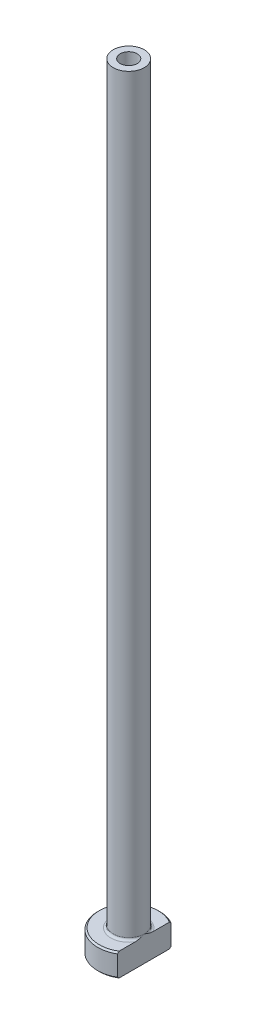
ISO-10303-21;
HEADER;
FILE_DESCRIPTION(('STEP AP214'),'2;1');
FILE_NAME('part.step','',(''),(''),'','','');
FILE_SCHEMA(('AUTOMOTIVE_DESIGN { 1 0 10303 214 1 1 1 1 }'));
ENDSEC;
DATA;
#1=APPLICATION_CONTEXT('core data for automotive mechanical design processes');
#2=APPLICATION_PROTOCOL_DEFINITION('international standard','automotive_design',2000,#1);
#3=PRODUCT_CONTEXT('',#1,'mechanical');
#4=PRODUCT('Part','Part','',(#3));
#5=PRODUCT_RELATED_PRODUCT_CATEGORY('part','',(#4));
#6=PRODUCT_DEFINITION_FORMATION('','',#4);
#7=PRODUCT_DEFINITION_CONTEXT('part definition',#1,'design');
#8=PRODUCT_DEFINITION('design','',#6,#7);
#9=PRODUCT_DEFINITION_SHAPE('','',#8);
#10=(LENGTH_UNIT() NAMED_UNIT(*) SI_UNIT(.MILLI.,.METRE.));
#11=(NAMED_UNIT(*) PLANE_ANGLE_UNIT() SI_UNIT($,.RADIAN.));
#12=(NAMED_UNIT(*) SI_UNIT($,.STERADIAN.) SOLID_ANGLE_UNIT());
#13=UNCERTAINTY_MEASURE_WITH_UNIT(LENGTH_MEASURE(1.E-05),#10,'distance_accuracy_value','');
#14=(GEOMETRIC_REPRESENTATION_CONTEXT(3) GLOBAL_UNCERTAINTY_ASSIGNED_CONTEXT((#13)) GLOBAL_UNIT_ASSIGNED_CONTEXT((#10,
#11,#12)) REPRESENTATION_CONTEXT('',''));
#15=CARTESIAN_POINT('',(0.,0.,0.));
#16=DIRECTION('',(0.,0.,1.));
#17=DIRECTION('',(1.,0.,0.));
#18=AXIS2_PLACEMENT_3D('',#15,#16,#17);
#19=CARTESIAN_POINT('',(0.,92.1876809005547,0.));
#20=DIRECTION('',(0.,1.,0.));
#21=DIRECTION('',(0.,0.,1.));
#22=AXIS2_PLACEMENT_3D('',#19,#20,#21);
#23=CYLINDRICAL_SURFACE('',#22,1.1);
#24=CARTESIAN_POINT('',(0.,100.,0.));
#25=DIRECTION('',(0.,1.,0.));
#26=DIRECTION('',(0.,0.,1.));
#27=AXIS2_PLACEMENT_3D('',#24,#25,#26);
#28=CIRCLE('',#27,1.1);
#29=CARTESIAN_POINT('',(0.,100.,1.1));
#30=VERTEX_POINT('',#29);
#31=EDGE_CURVE('E167',#30,#30,#28,.T.);
#32=ORIENTED_EDGE('',*,*,#31,.T.);
#33=EDGE_LOOP('',(#32));
#34=FACE_BOUND('',#33,.T.);
#35=CARTESIAN_POINT('',(0.,65.,0.));
#36=DIRECTION('',(0.,1.,0.));
#37=DIRECTION('',(0.,0.,1.));
#38=AXIS2_PLACEMENT_3D('',#35,#36,#37);
#39=CIRCLE('',#38,1.1);
#40=CARTESIAN_POINT('',(0.,65.,1.1));
#41=VERTEX_POINT('',#40);
#42=EDGE_CURVE('E170',#41,#41,#39,.T.);
#43=ORIENTED_EDGE('',*,*,#42,.F.);
#44=EDGE_LOOP('',(#43));
#45=FACE_BOUND('',#44,.T.);
#46=ADVANCED_FACE('F32',(#34,#45),#23,.F.);
#47=CARTESIAN_POINT('',(-1.1,100.,0.));
#48=DIRECTION('',(0.,1.,0.));
#49=DIRECTION('',(0.,0.,1.));
#50=AXIS2_PLACEMENT_3D('',#47,#48,#49);
#51=PLANE('',#50);
#52=CARTESIAN_POINT('',(0.,100.,0.));
#53=DIRECTION('',(0.,1.,0.));
#54=DIRECTION('',(0.,0.,1.));
#55=AXIS2_PLACEMENT_3D('',#52,#53,#54);
#56=CIRCLE('',#55,2.);
#57=CARTESIAN_POINT('',(0.,100.,2.));
#58=VERTEX_POINT('',#57);
#59=EDGE_CURVE('E174',#58,#58,#56,.T.);
#60=ORIENTED_EDGE('',*,*,#59,.T.);
#61=EDGE_LOOP('',(#60));
#62=FACE_BOUND('',#61,.T.);
#63=ORIENTED_EDGE('',*,*,#31,.F.);
#64=EDGE_LOOP('',(#63));
#65=FACE_BOUND('',#64,.T.);
#66=ADVANCED_FACE('F157',(#62,#65),#51,.T.);
#67=CARTESIAN_POINT('',(0.,92.1876809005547,0.));
#68=DIRECTION('',(0.,1.,0.));
#69=DIRECTION('',(0.,0.,1.));
#70=AXIS2_PLACEMENT_3D('',#67,#68,#69);
#71=CYLINDRICAL_SURFACE('',#70,1.99999999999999);
#72=CARTESIAN_POINT('',(0.,3.3,0.));
#73=DIRECTION('',(0.,1.,0.));
#74=DIRECTION('',(0.,0.,1.));
#75=AXIS2_PLACEMENT_3D('',#72,#73,#74);
#76=CIRCLE('',#75,1.99999999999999);
#77=CARTESIAN_POINT('',(1.99999999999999,3.3,0.));
#78=VERTEX_POINT('',#77);
#79=EDGE_CURVE('E180',#78,#78,#76,.T.);
#80=ORIENTED_EDGE('',*,*,#79,.T.);
#81=EDGE_LOOP('',(#80));
#82=FACE_BOUND('',#81,.T.);
#83=ORIENTED_EDGE('',*,*,#59,.F.);
#84=EDGE_LOOP('',(#83));
#85=FACE_BOUND('',#84,.T.);
#86=ADVANCED_FACE('F162',(#82,#85),#71,.T.);
#87=CARTESIAN_POINT('',(-1.99999999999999,3.,0.));
#88=DIRECTION('',(0.,1.,0.));
#89=DIRECTION('',(0.,0.,1.));
#90=AXIS2_PLACEMENT_3D('',#87,#88,#89);
#91=PLANE('',#90);
#92=DIRECTION('',(0.,0.,1.));
#93=VECTOR('',#92,1.);
#94=CARTESIAN_POINT('',(1.99999999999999,3.,0.));
#95=LINE('',#94,#93);
#96=CARTESIAN_POINT('',(2.,3.,-3.23109888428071));
#97=VERTEX_POINT('',#96);
#98=CARTESIAN_POINT('',(1.99999999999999,3.,-1.13578166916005));
#99=VERTEX_POINT('',#98);
#100=EDGE_CURVE('E54',#97,#99,#95,.T.);
#101=ORIENTED_EDGE('',*,*,#100,.F.);
#102=CARTESIAN_POINT('',(0.,3.,0.));
#103=DIRECTION('',(0.,1.,0.));
#104=DIRECTION('',(0.,0.,1.));
#105=AXIS2_PLACEMENT_3D('',#102,#103,#104);
#106=CIRCLE('',#105,3.8);
#107=CARTESIAN_POINT('',(1.99999999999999,3.,3.23109888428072));
#108=VERTEX_POINT('',#107);
#109=EDGE_CURVE('E186',#97,#108,#106,.T.);
#110=ORIENTED_EDGE('',*,*,#109,.T.);
#111=CARTESIAN_POINT('',(1.99999999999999,3.,1.13578166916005));
#112=VERTEX_POINT('',#111);
#113=EDGE_CURVE('E134',#112,#108,#95,.T.);
#114=ORIENTED_EDGE('',*,*,#113,.F.);
#115=CARTESIAN_POINT('',(0.,3.,0.));
#116=DIRECTION('',(0.,1.,0.));
#117=DIRECTION('',(0.,0.,1.));
#118=AXIS2_PLACEMENT_3D('',#115,#116,#117);
#119=CIRCLE('',#118,2.29999999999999);
#120=EDGE_CURVE('E183',#112,#99,#119,.F.);
#121=ORIENTED_EDGE('',*,*,#120,.T.);
#122=EDGE_LOOP('',(#101,#110,#114,#121));
#123=FACE_BOUND('',#122,.T.);
#124=ADVANCED_FACE('F197',(#123),#91,.T.);
#125=CARTESIAN_POINT('',(0.,92.1876809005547,0.));
#126=DIRECTION('',(0.,1.,0.));
#127=DIRECTION('',(0.,0.,1.));
#128=AXIS2_PLACEMENT_3D('',#125,#126,#127);
#129=CYLINDRICAL_SURFACE('',#128,3.99999999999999);
#130=DIRECTION('',(0.,-1.,0.));
#131=VECTOR('',#130,1.);
#132=CARTESIAN_POINT('',(1.99999999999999,100.,3.46410161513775));
#133=LINE('',#132,#131);
#134=CARTESIAN_POINT('',(1.99999999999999,2.8,3.46410161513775));
#135=VERTEX_POINT('',#134);
#136=CARTESIAN_POINT('',(1.99999999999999,0.20000000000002,3.46410161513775));
#137=VERTEX_POINT('',#136);
#138=EDGE_CURVE('E82',#135,#137,#133,.T.);
#139=ORIENTED_EDGE('',*,*,#138,.F.);
#140=CARTESIAN_POINT('',(0.,2.8,0.));
#141=DIRECTION('',(0.,1.,0.));
#142=DIRECTION('',(0.,0.,1.));
#143=AXIS2_PLACEMENT_3D('',#140,#141,#142);
#144=CIRCLE('',#143,3.99999999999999);
#145=CARTESIAN_POINT('',(2.,2.8,-3.46410161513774));
#146=VERTEX_POINT('',#145);
#147=EDGE_CURVE('E95',#135,#146,#144,.F.);
#148=ORIENTED_EDGE('',*,*,#147,.T.);
#149=DIRECTION('',(0.,-1.,0.));
#150=VECTOR('',#149,1.);
#151=CARTESIAN_POINT('',(2.,100.,-3.46410161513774));
#152=LINE('',#151,#150);
#153=CARTESIAN_POINT('',(2.,0.200000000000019,-3.46410161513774));
#154=VERTEX_POINT('',#153);
#155=EDGE_CURVE('E192',#146,#154,#152,.T.);
#156=ORIENTED_EDGE('',*,*,#155,.T.);
#157=CARTESIAN_POINT('',(0.,0.20000000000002,0.));
#158=DIRECTION('',(0.,-1.,0.));
#159=DIRECTION('',(0.,0.,-1.));
#160=AXIS2_PLACEMENT_3D('',#157,#158,#159);
#161=CIRCLE('',#160,3.99999999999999);
#162=EDGE_CURVE('E98',#154,#137,#161,.F.);
#163=ORIENTED_EDGE('',*,*,#162,.T.);
#164=EDGE_LOOP('',(#139,#148,#156,#163));
#165=FACE_BOUND('',#164,.T.);
#166=ADVANCED_FACE('F190',(#165),#129,.T.);
#167=CARTESIAN_POINT('',(-3.99999999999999,0.,0.));
#168=DIRECTION('',(0.,-1.,0.));
#169=DIRECTION('',(0.,0.,-1.));
#170=AXIS2_PLACEMENT_3D('',#167,#168,#169);
#171=PLANE('',#170);
#172=CARTESIAN_POINT('',(0.,0.,0.));
#173=DIRECTION('',(0.,-1.,0.));
#174=DIRECTION('',(0.,0.,-1.));
#175=AXIS2_PLACEMENT_3D('',#172,#173,#174);
#176=CIRCLE('',#175,1.84999999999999);
#177=CARTESIAN_POINT('',(0.,0.,-1.84999999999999));
#178=VERTEX_POINT('',#177);
#179=EDGE_CURVE('E40',#178,#178,#176,.F.);
#180=ORIENTED_EDGE('',*,*,#179,.T.);
#181=EDGE_LOOP('',(#180));
#182=FACE_BOUND('',#181,.T.);
#183=DIRECTION('',(0.,0.,-1.));
#184=VECTOR('',#183,1.);
#185=CARTESIAN_POINT('',(1.99999999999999,0.,3.46410161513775));
#186=LINE('',#185,#184);
#187=CARTESIAN_POINT('',(1.99999999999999,0.,3.23109888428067));
#188=VERTEX_POINT('',#187);
#189=CARTESIAN_POINT('',(2.,0.,-3.23109888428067));
#190=VERTEX_POINT('',#189);
#191=EDGE_CURVE('E47',#188,#190,#186,.T.);
#192=ORIENTED_EDGE('',*,*,#191,.F.);
#193=CARTESIAN_POINT('',(0.,0.,0.));
#194=DIRECTION('',(0.,-1.,0.));
#195=DIRECTION('',(0.,0.,-1.));
#196=AXIS2_PLACEMENT_3D('',#193,#194,#195);
#197=CIRCLE('',#196,3.79999999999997);
#198=EDGE_CURVE('E92',#188,#190,#197,.T.);
#199=ORIENTED_EDGE('',*,*,#198,.T.);
#200=EDGE_LOOP('',(#192,#199));
#201=FACE_BOUND('',#200,.T.);
#202=ADVANCED_FACE('F91',(#182,#201),#171,.T.);
#203=CARTESIAN_POINT('',(0.,92.1876809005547,0.));
#204=DIRECTION('',(0.,1.,0.));
#205=DIRECTION('',(0.,0.,1.));
#206=AXIS2_PLACEMENT_3D('',#203,#204,#205);
#207=CYLINDRICAL_SURFACE('',#206,1.34999999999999);
#208=CARTESIAN_POINT('',(0.,0.5,0.));
#209=DIRECTION('',(0.,-1.,0.));
#210=DIRECTION('',(0.,0.,-1.));
#211=AXIS2_PLACEMENT_3D('',#208,#209,#210);
#212=CIRCLE('',#211,1.34999999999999);
#213=CARTESIAN_POINT('',(0.,0.5,-1.34999999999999));
#214=VERTEX_POINT('',#213);
#215=EDGE_CURVE('E11',#214,#214,#212,.T.);
#216=ORIENTED_EDGE('',*,*,#215,.T.);
#217=EDGE_LOOP('',(#216));
#218=FACE_BOUND('',#217,.T.);
#219=CARTESIAN_POINT('',(0.,53.,0.));
#220=DIRECTION('',(0.,1.,0.));
#221=DIRECTION('',(0.,0.,1.));
#222=AXIS2_PLACEMENT_3D('',#219,#220,#221);
#223=CIRCLE('',#222,1.35);
#224=CARTESIAN_POINT('',(0.,53.,1.35));
#225=VERTEX_POINT('',#224);
#226=EDGE_CURVE('E172',#225,#225,#223,.T.);
#227=ORIENTED_EDGE('',*,*,#226,.T.);
#228=EDGE_LOOP('',(#227));
#229=FACE_BOUND('',#228,.T.);
#230=ADVANCED_FACE('F215',(#218,#229),#207,.F.);
#231=CARTESIAN_POINT('',(0.,53.,0.));
#232=DIRECTION('',(0.,-1.,0.));
#233=DIRECTION('',(0.,0.,-1.));
#234=AXIS2_PLACEMENT_3D('',#231,#232,#233);
#235=CONICAL_SURFACE('',#234,1.35,0.0208303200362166);
#236=ORIENTED_EDGE('',*,*,#42,.T.);
#237=EDGE_LOOP('',(#236));
#238=FACE_BOUND('',#237,.T.);
#239=ORIENTED_EDGE('',*,*,#226,.F.);
#240=EDGE_LOOP('',(#239));
#241=FACE_BOUND('',#240,.T.);
#242=ADVANCED_FACE('F111',(#238,#241),#235,.F.);
#243=CARTESIAN_POINT('',(0.,3.3,0.));
#244=DIRECTION('',(0.,1.,0.));
#245=DIRECTION('',(0.,0.,1.));
#246=AXIS2_PLACEMENT_3D('',#243,#244,#245);
#247=TOROIDAL_SURFACE('',#246,2.29999999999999,0.3);
#248=ORIENTED_EDGE('',*,*,#120,.F.);
#249=CARTESIAN_POINT('',(1.99999999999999,3.3,0.));
#250=CARTESIAN_POINT('',(1.99999999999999,3.30000062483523,7.91058839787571E-11));
#251=CARTESIAN_POINT('',(1.99999999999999,3.30000124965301,1.38466933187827E-07));
#252=CARTESIAN_POINT('',(1.99999999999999,3.30000244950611,5.7250701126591E-07));
#253=CARTESIAN_POINT('',(1.99999999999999,3.30000302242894,8.72848879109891E-07));
#254=CARTESIAN_POINT('',(1.99999999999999,3.30000416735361,1.5933593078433E-06));
#255=CARTESIAN_POINT('',(1.99999999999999,3.30000473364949,2.02244682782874E-06));
#256=CARTESIAN_POINT('',(1.99999999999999,3.30000579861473,2.94494833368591E-06));
#257=CARTESIAN_POINT('',(1.99999999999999,3.3000062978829,3.43770297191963E-06));
#258=CARTESIAN_POINT('',(1.99999999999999,3.30000798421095,5.21460055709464E-06));
#259=CARTESIAN_POINT('',(1.99999999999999,3.30000908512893,6.58180891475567E-06));
#260=CARTESIAN_POINT('',(1.99999999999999,3.30001103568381,9.39775301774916E-06));
#261=CARTESIAN_POINT('',(1.99999999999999,3.30001189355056,1.08411098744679E-05));
#262=CARTESIAN_POINT('',(1.99999999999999,3.30001514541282,1.6512277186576E-05));
#263=CARTESIAN_POINT('',(1.99999999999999,3.30001737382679,2.08398778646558E-05));
#264=CARTESIAN_POINT('',(1.99999999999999,3.30002099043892,2.93440758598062E-05));
#265=CARTESIAN_POINT('',(1.99999999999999,3.30002243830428,3.34960292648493E-05));
#266=CARTESIAN_POINT('',(1.99999999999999,3.30002863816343,5.12890566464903E-05));
#267=CARTESIAN_POINT('',(1.99999999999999,3.30003337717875,6.49250928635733E-05));
#268=CARTESIAN_POINT('',(1.99999999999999,3.3000409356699,9.03829816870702E-05));
#269=CARTESIAN_POINT('',(2.,3.30004394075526,0.000102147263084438));
#270=CARTESIAN_POINT('',(2.,3.3000678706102,0.000188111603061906));
#271=CARTESIAN_POINT('',(2.,3.30009855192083,0.000259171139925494));
#272=CARTESIAN_POINT('',(1.99999999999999,3.30021378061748,0.000536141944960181));
#273=CARTESIAN_POINT('',(1.99999999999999,3.30029106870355,0.000744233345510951));
#274=CARTESIAN_POINT('',(2.,3.3005964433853,0.00155446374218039));
#275=CARTESIAN_POINT('',(2.,3.30083214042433,0.00215436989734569));
#276=CARTESIAN_POINT('',(1.99999999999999,3.30179425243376,0.00461477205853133));
#277=CARTESIAN_POINT('',(1.99999999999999,3.30251207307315,0.00647773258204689));
#278=CARTESIAN_POINT('',(2.00000000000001,3.31311632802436,0.0339840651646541));
#279=CARTESIAN_POINT('',(2.,3.32306890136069,0.0596088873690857));
#280=CARTESIAN_POINT('',(1.99999999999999,3.34248629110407,0.10994696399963));
#281=CARTESIAN_POINT('',(1.99999999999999,3.35195547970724,0.134658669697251));
#282=CARTESIAN_POINT('',(2.,3.37186796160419,0.187046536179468));
#283=CARTESIAN_POINT('',(2.,3.38229466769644,0.21472913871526));
#284=CARTESIAN_POINT('',(1.99999999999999,3.40297705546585,0.270480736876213));
#285=CARTESIAN_POINT('',(2.,3.41322989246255,0.298550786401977));
#286=CARTESIAN_POINT('',(2.,3.43806738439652,0.3680077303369));
#287=CARTESIAN_POINT('',(2.,3.45243182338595,0.409474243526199));
#288=CARTESIAN_POINT('',(2.,3.47965482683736,0.491807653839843));
#289=CARTESIAN_POINT('',(2.,3.49254110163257,0.53266532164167));
#290=CARTESIAN_POINT('',(2.,3.51851192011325,0.620554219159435));
#291=CARTESIAN_POINT('',(2.,3.53137383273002,0.667652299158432));
#292=CARTESIAN_POINT('',(2.,3.55459547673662,0.762854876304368));
#293=CARTESIAN_POINT('',(2.,3.56493539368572,0.810964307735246));
#294=CARTESIAN_POINT('',(2.,3.58270957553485,0.910933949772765));
#295=CARTESIAN_POINT('',(2.,3.58991426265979,0.962836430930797));
#296=CARTESIAN_POINT('',(2.,3.59906919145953,1.06698400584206));
#297=CARTESIAN_POINT('',(2.,3.60103790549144,1.11922724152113));
#298=CARTESIAN_POINT('',(2.,3.59819318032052,1.21399009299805));
#299=CARTESIAN_POINT('',(2.,3.59455548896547,1.25653871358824));
#300=CARTESIAN_POINT('',(2.,3.58116512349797,1.34017723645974));
#301=CARTESIAN_POINT('',(2.,3.5715020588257,1.38127935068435));
#302=CARTESIAN_POINT('',(2.,3.55087659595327,1.4410977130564));
#303=CARTESIAN_POINT('',(2.,3.54291246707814,1.46084510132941));
#304=CARTESIAN_POINT('',(2.,3.52453399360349,1.49924523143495));
#305=CARTESIAN_POINT('',(2.,3.51411538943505,1.51789599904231));
#306=CARTESIAN_POINT('',(2.,3.49255299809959,1.55022658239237));
#307=CARTESIAN_POINT('',(2.,3.48185951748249,1.56420357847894));
#308=CARTESIAN_POINT('',(2.,3.45839348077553,1.59028758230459));
#309=CARTESIAN_POINT('',(2.,3.44562585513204,1.60239889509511));
#310=CARTESIAN_POINT('',(2.,3.42183279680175,1.62093425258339));
#311=CARTESIAN_POINT('',(2.,3.41131183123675,1.6280029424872));
#312=CARTESIAN_POINT('',(2.,3.38926242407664,1.64036132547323));
#313=CARTESIAN_POINT('',(2.,3.37773458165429,1.64565206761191));
#314=CARTESIAN_POINT('',(2.,3.3537976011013,1.65410966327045));
#315=CARTESIAN_POINT('',(2.,3.34138166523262,1.65725762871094));
#316=CARTESIAN_POINT('',(2.,3.31617371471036,1.661060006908));
#317=CARTESIAN_POINT('',(2.,3.30338200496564,1.66171638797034));
#318=CARTESIAN_POINT('',(2.,3.27959278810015,1.6605584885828));
#319=CARTESIAN_POINT('',(2.,3.26857876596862,1.65905512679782));
#320=CARTESIAN_POINT('',(2.,3.24695777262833,1.65423593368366));
#321=CARTESIAN_POINT('',(2.,3.2363508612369,1.65091983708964));
#322=CARTESIAN_POINT('',(2.,3.21566894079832,1.64264699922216));
#323=CARTESIAN_POINT('',(2.,3.20560117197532,1.63767239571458));
#324=CARTESIAN_POINT('',(2.,3.18626855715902,1.62636415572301));
#325=CARTESIAN_POINT('',(2.,3.1770040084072,1.62003001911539));
#326=CARTESIAN_POINT('',(2.,3.15429988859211,1.60233802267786));
#327=CARTESIAN_POINT('',(2.,3.14148777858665,1.59017362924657));
#328=CARTESIAN_POINT('',(2.,3.11794267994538,1.56396532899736));
#329=CARTESIAN_POINT('',(2.,3.10721625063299,1.54991572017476));
#330=CARTESIAN_POINT('',(2.,3.08234423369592,1.5125320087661));
#331=CARTESIAN_POINT('',(2.,3.06952968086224,1.48831711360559));
#332=CARTESIAN_POINT('',(2.,3.0477395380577,1.43832020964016));
#333=CARTESIAN_POINT('',(2.,3.03876197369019,1.41253901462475));
#334=CARTESIAN_POINT('',(2.,3.01850750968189,1.34101817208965));
#335=CARTESIAN_POINT('',(2.,3.01031623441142,1.29441496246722));
#336=CARTESIAN_POINT('',(2.,3.00061264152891,1.19993212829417));
#337=CARTESIAN_POINT('',(2.,2.99920833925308,1.15204398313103));
#338=CARTESIAN_POINT('',(2.,3.00193088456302,1.04246961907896));
#339=CARTESIAN_POINT('',(2.,3.0077920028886,0.980836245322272));
#340=CARTESIAN_POINT('',(2.,3.0256292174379,0.858294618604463));
#341=CARTESIAN_POINT('',(2.,3.03763032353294,0.797390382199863));
#342=CARTESIAN_POINT('',(2.,3.06494905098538,0.681046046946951));
#343=CARTESIAN_POINT('',(2.,3.07996031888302,0.625531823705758));
#344=CARTESIAN_POINT('',(2.,3.11250087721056,0.515805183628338));
#345=CARTESIAN_POINT('',(2.,3.13000629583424,0.461585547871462));
#346=CARTESIAN_POINT('',(2.,3.15814737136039,0.379074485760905));
#347=CARTESIAN_POINT('',(2.,3.16814918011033,0.350562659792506));
#348=CARTESIAN_POINT('',(2.,3.18879761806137,0.292954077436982));
#349=CARTESIAN_POINT('',(2.,3.19945417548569,0.263860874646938));
#350=CARTESIAN_POINT('',(2.,3.21767622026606,0.214869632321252));
#351=CARTESIAN_POINT('',(2.,3.22516548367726,0.194943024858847));
#352=CARTESIAN_POINT('',(2.,3.24017206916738,0.15532752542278));
#353=CARTESIAN_POINT('',(2.,3.24768836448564,0.135638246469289));
#354=CARTESIAN_POINT('',(1.99999999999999,3.26198776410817,0.098344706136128));
#355=CARTESIAN_POINT('',(1.99999999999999,3.26876515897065,0.0807381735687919));
#356=CARTESIAN_POINT('',(2.,3.28263254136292,0.0448719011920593));
#357=CARTESIAN_POINT('',(2.,3.28972459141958,0.0266128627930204));
#358=CARTESIAN_POINT('',(1.99999999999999,3.29748742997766,0.00647923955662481));
#359=CARTESIAN_POINT('',(1.99999999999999,3.29820461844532,0.00461774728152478));
#360=CARTESIAN_POINT('',(2.,3.29916656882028,0.00215769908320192));
#361=CARTESIAN_POINT('',(2.,3.29940270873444,0.00155667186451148));
#362=CARTESIAN_POINT('',(1.99999999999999,3.2997086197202,0.000745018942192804));
#363=CARTESIAN_POINT('',(1.99999999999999,3.29978601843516,0.000536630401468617));
#364=CARTESIAN_POINT('',(2.,3.29990139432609,0.000259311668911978));
#365=CARTESIAN_POINT('',(2.,3.2999320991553,0.000188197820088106));
#366=CARTESIAN_POINT('',(2.,3.29995604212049,0.0001021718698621));
#367=CARTESIAN_POINT('',(1.99999999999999,3.29995904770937,9.04035938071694E-05));
#368=CARTESIAN_POINT('',(1.99999999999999,3.29996660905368,6.49368757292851E-05));
#369=CARTESIAN_POINT('',(1.99999999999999,3.29997135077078,5.12961127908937E-05));
#370=CARTESIAN_POINT('',(1.99999999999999,3.29997755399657,3.34977848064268E-05));
#371=CARTESIAN_POINT('',(1.99999999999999,3.29997900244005,2.93452177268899E-05));
#372=CARTESIAN_POINT('',(1.99999999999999,3.29998262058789,2.08398566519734E-05));
#373=CARTESIAN_POINT('',(1.99999999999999,3.29998484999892,1.65117297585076E-05));
#374=CARTESIAN_POINT('',(1.99999999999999,3.29998810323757,1.08400635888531E-05));
#375=CARTESIAN_POINT('',(1.99999999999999,3.29998896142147,9.39665900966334E-06));
#376=CARTESIAN_POINT('',(1.99999999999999,3.29999091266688,6.58068185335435E-06));
#377=CARTESIAN_POINT('',(1.99999999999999,3.2999920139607,5.2134916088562E-06));
#378=CARTESIAN_POINT('',(1.99999999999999,3.29999370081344,3.43669337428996E-06));
#379=CARTESIAN_POINT('',(1.99999999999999,3.29999420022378,2.94398228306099E-06));
#380=CARTESIAN_POINT('',(1.99999999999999,3.29999526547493,2.0215933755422E-06));
#381=CARTESIAN_POINT('',(1.99999999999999,3.2999958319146,1.5925752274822E-06));
#382=CARTESIAN_POINT('',(1.99999999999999,3.29999697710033,8.72232370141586E-07));
#383=CARTESIAN_POINT('',(1.99999999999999,3.29999755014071,5.71985041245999E-07));
#384=CARTESIAN_POINT('',(1.99999999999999,3.29999875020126,1.38175028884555E-07));
#385=CARTESIAN_POINT('',(1.99999999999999,3.29999937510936,-7.91123985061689E-11));
#386=CARTESIAN_POINT('',(1.99999999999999,3.3,0.));
#387=B_SPLINE_CURVE_WITH_KNOTS('',3,(#249,#250,#251,#252,#253,#254,#255,#256,#257,#258,#259,
#260,#261,#262,#263,#264,#265,#266,#267,#268,#269,#270,#271,#272,#273,#274,#275,#276,#277,#278,
#279,#280,#281,#282,#283,#284,#285,#286,#287,#288,#289,#290,#291,#292,#293,#294,#295,#296,#297,
#298,#299,#300,#301,#302,#303,#304,#305,#306,#307,#308,#309,#310,#311,#312,#313,#314,#315,#316,
#317,#318,#319,#320,#321,#322,#323,#324,#325,#326,#327,#328,#329,#330,#331,#332,#333,#334,#335,
#336,#337,#338,#339,#340,#341,#342,#343,#344,#345,#346,#347,#348,#349,#350,#351,#352,#353,#354,
#355,#356,#357,#358,#359,#360,#361,#362,#363,#364,#365,#366,#367,#368,#369,#370,#371,#372,#373,
#374,#375,#376,#377,#378,#379,#380,#381,#382,#383,#384,#385,#386),.UNSPECIFIED.,.T.,.F.,(4,2,2,
2,2,2,2,2,2,2,2,2,2,2,2,2,2,2,2,2,2,2,2,2,2,2,2,2,2,2,2,2,2,2,2,2,2,2,2,2,2,2,2,2,2,2,2,2,2,2,2,
2,2,2,2,2,2,2,2,2,2,2,2,2,2,2,2,2,4),(0.,1.87392294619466E-06,3.80527491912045E-06,
5.92782328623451E-06,8.02992883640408E-06,1.32707966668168E-05,1.83039493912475E-05,
3.28629532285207E-05,4.60403137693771E-05,8.93409898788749E-05,0.000125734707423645,
0.000357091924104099,0.0010237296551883,0.00295649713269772,0.00894682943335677,
0.0914075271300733,0.170800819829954,0.259542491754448,0.349192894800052,0.480831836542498,
0.609336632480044,0.755749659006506,0.903278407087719,1.06029304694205,1.21675300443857,
1.34456674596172,1.47052354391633,1.53427785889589,1.59814364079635,1.65076980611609,
1.70327265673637,1.74115950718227,1.77902396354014,1.81721800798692,1.85538187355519,
1.88857073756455,1.92176445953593,1.95532789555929,1.98890369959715,2.0416028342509,
2.09446511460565,2.17619131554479,2.2578754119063,2.39903747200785,2.54243890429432,
2.72770087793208,2.91372355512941,3.08615579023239,3.25703652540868,3.34768022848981,
3.44062797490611,3.50449043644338,3.56771526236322,3.62431442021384,3.68307253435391,
3.68905809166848,3.6909944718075,3.69166206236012,3.69189359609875,3.69193000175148,
3.69197331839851,3.69198649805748,3.69200105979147,3.69200609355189,3.69201133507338,
3.69201343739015,3.69201556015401,3.69201749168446,3.69201936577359),.UNSPECIFIED.);
#388=EDGE_CURVE('E126',#112,#78,#387,.T.);
#389=ORIENTED_EDGE('',*,*,#388,.T.);
#390=ORIENTED_EDGE('',*,*,#79,.F.);
#391=CARTESIAN_POINT('',(1.99999999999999,3.3,0.));
#392=CARTESIAN_POINT('',(1.99999999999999,3.29999937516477,-7.91054267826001E-11));
#393=CARTESIAN_POINT('',(1.99999999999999,3.29999875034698,-1.38466932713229E-07));
#394=CARTESIAN_POINT('',(1.99999999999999,3.29999755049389,-5.7250701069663E-07));
#395=CARTESIAN_POINT('',(1.99999999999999,3.29999697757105,-8.72848878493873E-07));
#396=CARTESIAN_POINT('',(1.99999999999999,3.29999583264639,-1.59335930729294E-06));
#397=CARTESIAN_POINT('',(1.99999999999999,3.29999526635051,-2.02244682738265E-06));
#398=CARTESIAN_POINT('',(1.99999999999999,3.29999420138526,-2.94494833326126E-06));
#399=CARTESIAN_POINT('',(1.99999999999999,3.2999937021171,-3.43770297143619E-06));
#400=CARTESIAN_POINT('',(1.99999999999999,3.29999201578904,-5.21460055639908E-06));
#401=CARTESIAN_POINT('',(1.99999999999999,3.29999091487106,-6.58180891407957E-06));
#402=CARTESIAN_POINT('',(1.99999999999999,3.29998896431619,-9.39775301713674E-06));
#403=CARTESIAN_POINT('',(1.99999999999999,3.29998810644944,-1.08411098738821E-05));
#404=CARTESIAN_POINT('',(1.99999999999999,3.29998485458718,-1.65122771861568E-05));
#405=CARTESIAN_POINT('',(1.99999999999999,3.29998262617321,-2.08398778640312E-05));
#406=CARTESIAN_POINT('',(1.99999999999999,3.29997900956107,-2.93440758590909E-05));
#407=CARTESIAN_POINT('',(1.99999999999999,3.29997756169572,-3.34960292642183E-05));
#408=CARTESIAN_POINT('',(1.99999999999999,3.29997136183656,-5.12890566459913E-05));
#409=CARTESIAN_POINT('',(1.99999999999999,3.29996662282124,-6.49250928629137E-05));
#410=CARTESIAN_POINT('',(1.99999999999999,3.2999590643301,-9.03829816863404E-05));
#411=CARTESIAN_POINT('',(2.,3.29995605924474,-0.000102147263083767));
#412=CARTESIAN_POINT('',(2.,3.29993212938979,-0.000188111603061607));
#413=CARTESIAN_POINT('',(2.,3.29990144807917,-0.000259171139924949));
#414=CARTESIAN_POINT('',(1.99999999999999,3.29978621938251,-0.000536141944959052));
#415=CARTESIAN_POINT('',(1.99999999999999,3.29970893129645,-0.000744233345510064));
#416=CARTESIAN_POINT('',(2.,3.2994035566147,-0.00155446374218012));
#417=CARTESIAN_POINT('',(2.,3.29916785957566,-0.00215436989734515));
#418=CARTESIAN_POINT('',(1.99999999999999,3.29820574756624,-0.00461477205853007));
#419=CARTESIAN_POINT('',(1.99999999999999,3.29748792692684,-0.00647773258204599));
#420=CARTESIAN_POINT('',(2.00000000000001,3.28688367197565,-0.0339840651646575));
#421=CARTESIAN_POINT('',(2.,3.27693109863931,-0.0596088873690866));
#422=CARTESIAN_POINT('',(1.99999999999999,3.25751370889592,-0.109946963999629));
#423=CARTESIAN_POINT('',(1.99999999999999,3.24804452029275,-0.134658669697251));
#424=CARTESIAN_POINT('',(2.,3.2281320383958,-0.187046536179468));
#425=CARTESIAN_POINT('',(2.,3.21770533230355,-0.214729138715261));
#426=CARTESIAN_POINT('',(1.99999999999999,3.19702294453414,-0.270480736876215));
#427=CARTESIAN_POINT('',(2.,3.18677010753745,-0.298550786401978));
#428=CARTESIAN_POINT('',(2.,3.16193261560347,-0.368007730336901));
#429=CARTESIAN_POINT('',(2.,3.14756817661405,-0.4094742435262));
#430=CARTESIAN_POINT('',(2.,3.12034517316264,-0.491807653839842));
#431=CARTESIAN_POINT('',(2.,3.10745889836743,-0.532665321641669));
#432=CARTESIAN_POINT('',(2.,3.08148807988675,-0.620554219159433));
#433=CARTESIAN_POINT('',(2.,3.06862616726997,-0.66765229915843));
#434=CARTESIAN_POINT('',(2.,3.04540452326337,-0.762854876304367));
#435=CARTESIAN_POINT('',(2.,3.03506460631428,-0.810964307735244));
#436=CARTESIAN_POINT('',(2.,3.01729042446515,-0.910933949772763));
#437=CARTESIAN_POINT('',(2.,3.01008573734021,-0.962836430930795));
#438=CARTESIAN_POINT('',(2.,3.00093080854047,-1.06698400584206));
#439=CARTESIAN_POINT('',(2.,2.99896209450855,-1.11922724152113));
#440=CARTESIAN_POINT('',(2.,3.00180681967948,-1.21399009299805));
#441=CARTESIAN_POINT('',(2.,3.00544451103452,-1.25653871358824));
#442=CARTESIAN_POINT('',(2.,3.01883487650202,-1.34017723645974));
#443=CARTESIAN_POINT('',(2.,3.0284979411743,-1.38127935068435));
#444=CARTESIAN_POINT('',(2.,3.04912340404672,-1.4410977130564));
#445=CARTESIAN_POINT('',(2.,3.05708753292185,-1.46084510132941));
#446=CARTESIAN_POINT('',(2.,3.0754660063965,-1.49924523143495));
#447=CARTESIAN_POINT('',(2.,3.08588461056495,-1.51789599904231));
#448=CARTESIAN_POINT('',(2.,3.10744700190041,-1.55022658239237));
#449=CARTESIAN_POINT('',(2.,3.11814048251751,-1.56420357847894));
#450=CARTESIAN_POINT('',(2.,3.14160651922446,-1.59028758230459));
#451=CARTESIAN_POINT('',(2.,3.15437414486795,-1.60239889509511));
#452=CARTESIAN_POINT('',(2.,3.17816720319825,-1.62093425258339));
#453=CARTESIAN_POINT('',(2.,3.18868816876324,-1.6280029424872));
#454=CARTESIAN_POINT('',(2.,3.21073757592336,-1.64036132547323));
#455=CARTESIAN_POINT('',(2.,3.2222654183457,-1.64565206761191));
#456=CARTESIAN_POINT('',(2.,3.2462023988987,-1.65410966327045));
#457=CARTESIAN_POINT('',(2.,3.25861833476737,-1.65725762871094));
#458=CARTESIAN_POINT('',(2.,3.28382628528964,-1.661060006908));
#459=CARTESIAN_POINT('',(2.,3.29661799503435,-1.66171638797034));
#460=CARTESIAN_POINT('',(2.,3.32040721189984,-1.6605584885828));
#461=CARTESIAN_POINT('',(2.,3.33142123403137,-1.65905512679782));
#462=CARTESIAN_POINT('',(2.,3.35304222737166,-1.65423593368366));
#463=CARTESIAN_POINT('',(2.,3.36364913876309,-1.65091983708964));
#464=CARTESIAN_POINT('',(2.,3.38433105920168,-1.64264699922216));
#465=CARTESIAN_POINT('',(2.,3.39439882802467,-1.63767239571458));
#466=CARTESIAN_POINT('',(2.,3.41373144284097,-1.62636415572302));
#467=CARTESIAN_POINT('',(2.,3.42299599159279,-1.62003001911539));
#468=CARTESIAN_POINT('',(2.,3.44570011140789,-1.60233802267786));
#469=CARTESIAN_POINT('',(2.,3.45851222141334,-1.59017362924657));
#470=CARTESIAN_POINT('',(2.,3.48205732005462,-1.56396532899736));
#471=CARTESIAN_POINT('',(2.,3.492783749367,-1.54991572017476));
#472=CARTESIAN_POINT('',(2.,3.51765576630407,-1.5125320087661));
#473=CARTESIAN_POINT('',(2.,3.53047031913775,-1.48831711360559));
#474=CARTESIAN_POINT('',(2.,3.55226046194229,-1.43832020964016));
#475=CARTESIAN_POINT('',(2.,3.56123802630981,-1.41253901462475));
#476=CARTESIAN_POINT('',(2.,3.58149249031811,-1.34101817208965));
#477=CARTESIAN_POINT('',(2.,3.58968376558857,-1.29441496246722));
#478=CARTESIAN_POINT('',(2.,3.59938735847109,-1.19993212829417));
#479=CARTESIAN_POINT('',(2.,3.60079166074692,-1.15204398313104));
#480=CARTESIAN_POINT('',(2.,3.59806911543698,-1.04246961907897));
#481=CARTESIAN_POINT('',(2.,3.5922079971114,-0.980836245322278));
#482=CARTESIAN_POINT('',(2.,3.57437078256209,-0.858294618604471));
#483=CARTESIAN_POINT('',(2.,3.56236967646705,-0.797390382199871));
#484=CARTESIAN_POINT('',(2.,3.53505094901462,-0.68104604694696));
#485=CARTESIAN_POINT('',(2.,3.52003968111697,-0.625531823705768));
#486=CARTESIAN_POINT('',(2.,3.48749912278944,-0.51580518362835));
#487=CARTESIAN_POINT('',(2.,3.46999370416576,-0.461585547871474));
#488=CARTESIAN_POINT('',(2.,3.44185262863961,-0.379074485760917));
#489=CARTESIAN_POINT('',(2.,3.43185081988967,-0.350562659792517));
#490=CARTESIAN_POINT('',(2.,3.41120238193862,-0.292954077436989));
#491=CARTESIAN_POINT('',(2.,3.40054582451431,-0.263860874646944));
#492=CARTESIAN_POINT('',(2.,3.38232377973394,-0.214869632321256));
#493=CARTESIAN_POINT('',(2.,3.37483451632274,-0.194943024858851));
#494=CARTESIAN_POINT('',(2.,3.35982793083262,-0.155327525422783));
#495=CARTESIAN_POINT('',(2.,3.35231163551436,-0.135638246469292));
#496=CARTESIAN_POINT('',(1.99999999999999,3.33801223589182,-0.0983447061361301));
#497=CARTESIAN_POINT('',(1.99999999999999,3.33123484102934,-0.0807381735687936));
#498=CARTESIAN_POINT('',(2.,3.31736745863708,-0.0448719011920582));
#499=CARTESIAN_POINT('',(2.,3.31027540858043,-0.0266128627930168));
#500=CARTESIAN_POINT('',(1.99999999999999,3.30251257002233,-0.00647923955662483));
#501=CARTESIAN_POINT('',(1.99999999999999,3.30179538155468,-0.00461774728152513));
#502=CARTESIAN_POINT('',(2.,3.30083343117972,-0.00215769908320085));
#503=CARTESIAN_POINT('',(2.,3.30059729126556,-0.00155667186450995));
#504=CARTESIAN_POINT('',(1.99999999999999,3.30029138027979,-0.000745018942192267));
#505=CARTESIAN_POINT('',(1.99999999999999,3.30021398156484,-0.000536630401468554));
#506=CARTESIAN_POINT('',(2.,3.3000986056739,-0.000259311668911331));
#507=CARTESIAN_POINT('',(2.,3.3000679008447,-0.000188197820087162));
#508=CARTESIAN_POINT('',(2.,3.3000439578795,-0.000102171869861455));
#509=CARTESIAN_POINT('',(1.99999999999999,3.30004095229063,-9.04035938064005E-05));
#510=CARTESIAN_POINT('',(1.99999999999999,3.30003339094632,-6.49368757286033E-05));
#511=CARTESIAN_POINT('',(1.99999999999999,3.30002864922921,-5.12961127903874E-05));
#512=CARTESIAN_POINT('',(1.99999999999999,3.30002244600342,-3.34977848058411E-05));
#513=CARTESIAN_POINT('',(1.99999999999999,3.30002099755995,-2.9345217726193E-05));
#514=CARTESIAN_POINT('',(1.99999999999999,3.30001737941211,-2.08398566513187E-05));
#515=CARTESIAN_POINT('',(1.99999999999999,3.30001515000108,-1.65117297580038E-05));
#516=CARTESIAN_POINT('',(1.99999999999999,3.30001189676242,-1.08400635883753E-05));
#517=CARTESIAN_POINT('',(1.99999999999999,3.30001103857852,-9.39665900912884E-06));
#518=CARTESIAN_POINT('',(1.99999999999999,3.30000908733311,-6.58068185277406E-06));
#519=CARTESIAN_POINT('',(1.99999999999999,3.3000079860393,-5.2134916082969E-06));
#520=CARTESIAN_POINT('',(1.99999999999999,3.30000629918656,-3.43669337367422E-06));
#521=CARTESIAN_POINT('',(1.99999999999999,3.30000579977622,-2.94398228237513E-06));
#522=CARTESIAN_POINT('',(1.99999999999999,3.30000473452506,-2.02159337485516E-06));
#523=CARTESIAN_POINT('',(1.99999999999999,3.30000416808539,-1.59257522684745E-06));
#524=CARTESIAN_POINT('',(1.99999999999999,3.30000302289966,-8.72232369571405E-07));
#525=CARTESIAN_POINT('',(1.99999999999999,3.30000244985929,-5.71985040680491E-07));
#526=CARTESIAN_POINT('',(1.99999999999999,3.30000124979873,-1.38175028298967E-07));
#527=CARTESIAN_POINT('',(1.99999999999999,3.30000062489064,7.91129428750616E-11));
#528=CARTESIAN_POINT('',(1.99999999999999,3.3,0.));
#529=B_SPLINE_CURVE_WITH_KNOTS('',3,(#391,#392,#393,#394,#395,#396,#397,#398,#399,#400,#401,
#402,#403,#404,#405,#406,#407,#408,#409,#410,#411,#412,#413,#414,#415,#416,#417,#418,#419,#420,
#421,#422,#423,#424,#425,#426,#427,#428,#429,#430,#431,#432,#433,#434,#435,#436,#437,#438,#439,
#440,#441,#442,#443,#444,#445,#446,#447,#448,#449,#450,#451,#452,#453,#454,#455,#456,#457,#458,
#459,#460,#461,#462,#463,#464,#465,#466,#467,#468,#469,#470,#471,#472,#473,#474,#475,#476,#477,
#478,#479,#480,#481,#482,#483,#484,#485,#486,#487,#488,#489,#490,#491,#492,#493,#494,#495,#496,
#497,#498,#499,#500,#501,#502,#503,#504,#505,#506,#507,#508,#509,#510,#511,#512,#513,#514,#515,
#516,#517,#518,#519,#520,#521,#522,#523,#524,#525,#526,#527,#528),.UNSPECIFIED.,.T.,.F.,(4,2,2,
2,2,2,2,2,2,2,2,2,2,2,2,2,2,2,2,2,2,2,2,2,2,2,2,2,2,2,2,2,2,2,2,2,2,2,2,2,2,2,2,2,2,2,2,2,2,2,2,
2,2,2,2,2,2,2,2,2,2,2,2,2,2,2,2,2,4),(0.,1.87392294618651E-06,3.80527491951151E-06,
5.92782328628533E-06,8.02992883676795E-06,1.32707966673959E-05,1.83039493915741E-05,
3.28629532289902E-05,4.60403137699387E-05,8.93409898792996E-05,0.000125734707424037,
0.00035709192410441,0.00102372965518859,0.00295649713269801,0.00894682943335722,
0.0914075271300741,0.170800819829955,0.25954249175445,0.349192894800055,0.480831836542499,
0.609336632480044,0.755749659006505,0.903278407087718,1.06029304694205,1.21675300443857,
1.34456674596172,1.47052354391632,1.53427785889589,1.59814364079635,1.65076980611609,
1.70327265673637,1.74115950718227,1.77902396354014,1.81721800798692,1.85538187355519,
1.88857073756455,1.92176445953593,1.95532789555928,1.98890369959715,2.0416028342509,
2.09446511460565,2.17619131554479,2.25787541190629,2.39903747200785,2.54243890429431,
2.72770087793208,2.9137235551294,3.08615579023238,3.25703652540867,3.3476802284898,
3.44062797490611,3.50449043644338,3.56771526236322,3.62431442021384,3.68307253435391,
3.68905809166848,3.6909944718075,3.69166206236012,3.69189359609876,3.69193000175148,
3.69197331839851,3.69198649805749,3.69200105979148,3.6920060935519,3.69201133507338,
3.69201343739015,3.69201556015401,3.69201749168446,3.69201936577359),.UNSPECIFIED.);
#530=EDGE_CURVE('E135',#78,#99,#529,.T.);
#531=ORIENTED_EDGE('',*,*,#530,.T.);
#532=EDGE_LOOP('',(#248,#389,#390,#531));
#533=FACE_BOUND('',#532,.T.);
#534=ADVANCED_FACE('F141',(#533),#247,.F.);
#535=CARTESIAN_POINT('',(0.,3.,0.));
#536=DIRECTION('',(0.,-1.,0.));
#537=DIRECTION('',(0.,0.,-1.));
#538=AXIS2_PLACEMENT_3D('',#535,#536,#537);
#539=CONICAL_SURFACE('',#538,3.8,0.785398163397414);
#540=CARTESIAN_POINT('',(2.,-1.08095467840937,-7.62295524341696));
#541=CARTESIAN_POINT('',(2.,-0.913887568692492,-7.45022392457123));
#542=CARTESIAN_POINT('',(2.,-0.74699975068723,-7.27731861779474));
#543=CARTESIAN_POINT('',(2.,-0.413688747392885,-6.93105655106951));
#544=CARTESIAN_POINT('',(2.,-0.247265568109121,-6.75769978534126));
#545=CARTESIAN_POINT('',(2.,0.0850908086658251,-6.41034692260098));
#546=CARTESIAN_POINT('',(2.,0.251023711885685,-6.23635054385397));
#547=CARTESIAN_POINT('',(2.,0.582155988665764,-5.88766284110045));
#548=CARTESIAN_POINT('',(2.,0.747355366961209,-5.71297152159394));
#549=CARTESIAN_POINT('',(2.,1.07353855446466,-5.36616839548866));
#550=CARTESIAN_POINT('',(2.,1.23454099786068,-5.194074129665));
#551=CARTESIAN_POINT('',(2.,1.55534102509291,-4.84876663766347));
#552=CARTESIAN_POINT('',(2.,1.71513861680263,-4.67555341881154));
#553=CARTESIAN_POINT('',(2.,2.03306183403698,-4.32766569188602));
#554=CARTESIAN_POINT('',(2.,2.19118781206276,-4.15299150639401));
#555=CARTESIAN_POINT('',(2.,2.50513944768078,-3.80159134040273));
#556=CARTESIAN_POINT('',(2.,2.66096519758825,-3.62486544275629));
#557=CARTESIAN_POINT('',(2.,2.90974646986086,-3.33722425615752));
#558=CARTESIAN_POINT('',(2.,3.00376148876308,-3.22722645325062));
#559=CARTESIAN_POINT('',(2.,3.1901182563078,-3.0057998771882));
#560=CARTESIAN_POINT('',(2.,3.28245983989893,-2.89437096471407));
#561=CARTESIAN_POINT('',(2.,3.46586188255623,-2.66849662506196));
#562=CARTESIAN_POINT('',(2.,3.55689849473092,-2.5540317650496));
#563=CARTESIAN_POINT('',(2.,3.73578809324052,-2.32266819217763));
#564=CARTESIAN_POINT('',(2.,3.82364184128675,-2.20577007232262));
#565=CARTESIAN_POINT('',(2.,3.99612756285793,-1.96688707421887));
#566=CARTESIAN_POINT('',(2.,4.08069035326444,-1.84485190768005));
#567=CARTESIAN_POINT('',(2.,4.24300264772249,-1.59599329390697));
#568=CARTESIAN_POINT('',(2.,4.32074277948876,-1.46916359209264));
#569=CARTESIAN_POINT('',(2.,4.42869763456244,-1.27510066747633));
#570=CARTESIAN_POINT('',(2.,4.46305374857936,-1.21018943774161));
#571=CARTESIAN_POINT('',(2.,4.52837146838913,-1.07868835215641));
#572=CARTESIAN_POINT('',(2.,4.55933245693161,-1.01209819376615));
#573=CARTESIAN_POINT('',(2.,4.645668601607,-0.809894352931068));
#574=CARTESIAN_POINT('',(2.,4.69478214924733,-0.671360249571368));
#575=CARTESIAN_POINT('',(2.,4.74794829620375,-0.463657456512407));
#576=CARTESIAN_POINT('',(2.,4.76205065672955,-0.397033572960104));
#577=CARTESIAN_POINT('',(2.,4.78390371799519,-0.262728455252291));
#578=CARTESIAN_POINT('',(2.,4.79165498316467,-0.19504731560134));
#579=CARTESIAN_POINT('',(2.,4.80025690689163,-0.0594528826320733));
#580=CARTESIAN_POINT('',(2.,4.80112894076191,0.00845903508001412));
#581=CARTESIAN_POINT('',(2.,4.79596585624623,0.14402068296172));
#582=CARTESIAN_POINT('',(2.,4.78993016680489,0.211670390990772));
#583=CARTESIAN_POINT('',(2.,4.77145363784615,0.34548399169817));
#584=CARTESIAN_POINT('',(2.,4.75906777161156,0.411655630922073));
#585=CARTESIAN_POINT('',(2.,4.72866360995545,0.542678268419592));
#586=CARTESIAN_POINT('',(2.,4.71064463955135,0.607529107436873));
#587=CARTESIAN_POINT('',(2.,4.66972939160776,0.736064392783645));
#588=CARTESIAN_POINT('',(2.,4.64680564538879,0.799739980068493));
#589=CARTESIAN_POINT('',(2.,4.59700147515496,0.925489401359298));
#590=CARTESIAN_POINT('',(2.,4.57012185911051,0.987563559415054));
#591=CARTESIAN_POINT('',(2.,4.48443518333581,1.17209020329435));
#592=CARTESIAN_POINT('',(2.,4.42077407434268,1.29228210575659));
#593=CARTESIAN_POINT('',(2.,4.28502644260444,1.52785770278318));
#594=CARTESIAN_POINT('',(1.99999999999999,4.21292931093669,1.64323509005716));
#595=CARTESIAN_POINT('',(1.99999999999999,4.06281517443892,1.87069387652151));
#596=CARTESIAN_POINT('',(1.99999999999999,3.98477595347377,1.98276048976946));
#597=CARTESIAN_POINT('',(1.99999999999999,3.82481971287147,2.20397837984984));
#598=CARTESIAN_POINT('',(1.99999999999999,3.7429046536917,2.31313108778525));
#599=CARTESIAN_POINT('',(1.99999999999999,3.57517222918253,2.53068545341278));
#600=CARTESIAN_POINT('',(1.99999999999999,3.489317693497,2.63905831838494));
#601=CARTESIAN_POINT('',(1.99999999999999,3.31548151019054,2.85409686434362));
#602=CARTESIAN_POINT('',(1.99999999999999,3.22749963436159,2.96076236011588));
#603=CARTESIAN_POINT('',(1.99999999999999,3.05015030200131,3.17249211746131));
#604=CARTESIAN_POINT('',(1.99999999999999,2.96078672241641,3.27755963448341));
#605=CARTESIAN_POINT('',(1.99999999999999,2.78082366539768,3.48663191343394));
#606=CARTESIAN_POINT('',(1.99999999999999,2.69022416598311,3.59063665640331));
#607=CARTESIAN_POINT('',(1.99999999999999,2.4479673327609,3.8661243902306));
#608=CARTESIAN_POINT('',(1.99999999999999,2.29545972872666,4.03685912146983));
#609=CARTESIAN_POINT('',(1.99999999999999,1.98858070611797,4.37664803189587));
#610=CARTESIAN_POINT('',(1.99999999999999,1.83420923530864,4.54570216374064));
#611=CARTESIAN_POINT('',(1.99999999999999,1.52396102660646,4.88271638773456));
#612=CARTESIAN_POINT('',(1.99999999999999,1.3680830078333,5.05067529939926));
#613=CARTESIAN_POINT('',(1.99999999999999,1.0553051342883,5.38563883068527));
#614=CARTESIAN_POINT('',(1.99999999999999,0.898405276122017,5.55264344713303));
#615=CARTESIAN_POINT('',(1.99999999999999,0.590290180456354,5.87905385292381));
#616=CARTESIAN_POINT('',(1.99999999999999,0.439106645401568,6.03848959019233));
#617=CARTESIAN_POINT('',(1.99999999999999,0.136164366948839,6.35681456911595));
#618=CARTESIAN_POINT('',(1.99999999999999,-0.0155943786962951,6.51570380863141));
#619=CARTESIAN_POINT('',(1.99999999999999,-0.319404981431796,6.83286192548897));
#620=CARTESIAN_POINT('',(1.99999999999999,-0.471456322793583,6.9911312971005));
#621=CARTESIAN_POINT('',(1.99999999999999,-0.775939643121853,7.3073010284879));
#622=CARTESIAN_POINT('',(1.99999999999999,-0.928371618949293,7.46520139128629));
#623=CARTESIAN_POINT('',(1.99999999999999,-1.08095467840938,7.62295524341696));
#624=B_SPLINE_CURVE_WITH_KNOTS('',3,(#540,#541,#542,#543,#544,#545,#546,#547,#548,#549,#550,
#551,#552,#553,#554,#555,#556,#557,#558,#559,#560,#561,#562,#563,#564,#565,#566,#567,#568,#569,
#570,#571,#572,#573,#574,#575,#576,#577,#578,#579,#580,#581,#582,#583,#584,#585,#586,#587,#588,
#589,#590,#591,#592,#593,#594,#595,#596,#597,#598,#599,#600,#601,#602,#603,#604,#605,#606,#607,
#608,#609,#610,#611,#612,#613,#614,#615,#616,#617,#618,#619,#620,#621,#622,#623),.UNSPECIFIED.,
.F.,.F.,(4,2,2,2,2,2,2,2,2,2,2,2,2,2,2,2,2,2,2,2,2,2,2,2,2,2,2,2,2,2,2,2,2,2,2,2,2,2,2,2,2,4),
(0.,0.720921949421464,1.44185317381,2.16315326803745,2.8844486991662,3.59144103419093,
4.29842874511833,5.00526427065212,5.71207135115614,6.14616174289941,6.58029471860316,
7.01901494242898,7.45762947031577,7.90290456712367,8.34878206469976,8.56901415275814,
8.78928621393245,9.22814472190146,9.43219512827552,9.63622739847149,9.83962544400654,
10.043040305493,10.2447232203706,10.4464303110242,10.649298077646,10.8521244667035,
11.2595582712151,11.6675100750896,12.0770700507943,12.4864250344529,12.901167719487,
13.3159550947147,13.7297367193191,14.1435257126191,14.8302935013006,15.5170805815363,
16.2045145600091,16.8919508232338,17.5511045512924,18.2102608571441,18.8686819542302,
19.5270976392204),.UNSPECIFIED.);
#625=EDGE_CURVE('E133',#146,#97,#624,.T.);
#626=ORIENTED_EDGE('',*,*,#625,.F.);
#627=ORIENTED_EDGE('',*,*,#147,.F.);
#628=EDGE_CURVE('E118',#108,#135,#624,.T.);
#629=ORIENTED_EDGE('',*,*,#628,.F.);
#630=ORIENTED_EDGE('',*,*,#109,.F.);
#631=EDGE_LOOP('',(#626,#627,#629,#630));
#632=FACE_BOUND('',#631,.T.);
#633=ADVANCED_FACE('F145',(#632),#539,.T.);
#634=CARTESIAN_POINT('',(0.,0.20000000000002,0.));
#635=DIRECTION('',(0.,1.,0.));
#636=DIRECTION('',(0.,0.,1.));
#637=AXIS2_PLACEMENT_3D('',#634,#635,#636);
#638=CONICAL_SURFACE('',#637,3.99999999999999,0.785398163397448);
#639=CARTESIAN_POINT('',(1.99999999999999,4.08095467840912,7.62295524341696));
#640=CARTESIAN_POINT('',(1.99999999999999,3.91388756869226,7.45022392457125));
#641=CARTESIAN_POINT('',(1.99999999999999,3.74699975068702,7.27731861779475));
#642=CARTESIAN_POINT('',(1.99999999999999,3.41368874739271,6.93105655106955));
#643=CARTESIAN_POINT('',(1.99999999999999,3.24726556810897,6.75769978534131));
#644=CARTESIAN_POINT('',(1.99999999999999,2.91490919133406,6.41034692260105));
#645=CARTESIAN_POINT('',(1.99999999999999,2.74897628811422,6.23635054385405));
#646=CARTESIAN_POINT('',(1.99999999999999,2.41784401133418,5.88766284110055));
#647=CARTESIAN_POINT('',(1.99999999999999,2.25264463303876,5.71297152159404));
#648=CARTESIAN_POINT('',(1.99999999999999,1.92646144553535,5.36616839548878));
#649=CARTESIAN_POINT('',(1.99999999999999,1.76545900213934,5.19407412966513));
#650=CARTESIAN_POINT('',(1.99999999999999,1.44465897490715,4.84876663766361));
#651=CARTESIAN_POINT('',(1.99999999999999,1.28486138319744,4.67555341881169));
#652=CARTESIAN_POINT('',(1.99999999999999,0.96693816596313,4.32766569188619));
#653=CARTESIAN_POINT('',(1.99999999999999,0.80881218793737,4.15299150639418));
#654=CARTESIAN_POINT('',(1.99999999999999,0.494860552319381,3.80159134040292));
#655=CARTESIAN_POINT('',(1.99999999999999,0.339034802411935,3.62486544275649));
#656=CARTESIAN_POINT('',(1.99999999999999,0.0902535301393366,3.33722425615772));
#657=CARTESIAN_POINT('',(1.99999999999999,-0.00376148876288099,3.22722645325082));
#658=CARTESIAN_POINT('',(1.99999999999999,-0.190118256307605,3.00579987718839));
#659=CARTESIAN_POINT('',(1.99999999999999,-0.282459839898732,2.89437096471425));
#660=CARTESIAN_POINT('',(1.99999999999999,-0.465861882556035,2.66849662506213));
#661=CARTESIAN_POINT('',(1.99999999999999,-0.556898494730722,2.55403176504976));
#662=CARTESIAN_POINT('',(1.99999999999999,-0.735788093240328,2.32266819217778));
#663=CARTESIAN_POINT('',(1.99999999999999,-0.823641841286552,2.20577007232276));
#664=CARTESIAN_POINT('',(1.99999999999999,-0.996127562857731,1.96688707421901));
#665=CARTESIAN_POINT('',(2.,-1.08069035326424,1.84485190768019));
#666=CARTESIAN_POINT('',(2.,-1.2430026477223,1.59599329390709));
#667=CARTESIAN_POINT('',(2.,-1.32074277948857,1.46916359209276));
#668=CARTESIAN_POINT('',(2.,-1.42869763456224,1.27510066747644));
#669=CARTESIAN_POINT('',(2.,-1.46305374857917,1.21018943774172));
#670=CARTESIAN_POINT('',(2.,-1.52837146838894,1.07868835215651));
#671=CARTESIAN_POINT('',(2.,-1.55933245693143,1.01209819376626));
#672=CARTESIAN_POINT('',(2.,-1.64566860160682,0.809894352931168));
#673=CARTESIAN_POINT('',(2.,-1.69478214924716,0.671360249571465));
#674=CARTESIAN_POINT('',(2.,-1.74794829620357,0.463657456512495));
#675=CARTESIAN_POINT('',(2.,-1.76205065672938,0.397033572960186));
#676=CARTESIAN_POINT('',(2.,-1.78390371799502,0.26272845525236));
#677=CARTESIAN_POINT('',(2.,-1.79165498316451,0.195047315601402));
#678=CARTESIAN_POINT('',(2.,-1.80025690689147,0.0594528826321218));
#679=CARTESIAN_POINT('',(2.,-1.80112894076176,-0.00845903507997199));
#680=CARTESIAN_POINT('',(2.,-1.79596585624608,-0.144020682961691));
#681=CARTESIAN_POINT('',(2.,-1.78993016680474,-0.211670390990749));
#682=CARTESIAN_POINT('',(2.,-1.771453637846,-0.345483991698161));
#683=CARTESIAN_POINT('',(2.,-1.75906777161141,-0.41165563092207));
#684=CARTESIAN_POINT('',(2.,-1.72866360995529,-0.542678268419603));
#685=CARTESIAN_POINT('',(2.,-1.71064463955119,-0.60752910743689));
#686=CARTESIAN_POINT('',(2.,-1.6697293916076,-0.736064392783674));
#687=CARTESIAN_POINT('',(2.,-1.64680564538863,-0.799739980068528));
#688=CARTESIAN_POINT('',(2.,-1.59700147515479,-0.925489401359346));
#689=CARTESIAN_POINT('',(2.,-1.57012185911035,-0.987563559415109));
#690=CARTESIAN_POINT('',(2.,-1.48443518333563,-1.17209020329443));
#691=CARTESIAN_POINT('',(2.,-1.4207740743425,-1.29228210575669));
#692=CARTESIAN_POINT('',(2.,-1.28502644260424,-1.52785770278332));
#693=CARTESIAN_POINT('',(2.,-1.21292931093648,-1.64323509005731));
#694=CARTESIAN_POINT('',(2.,-1.06281517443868,-1.8706938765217));
#695=CARTESIAN_POINT('',(2.,-0.984775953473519,-1.98276048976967));
#696=CARTESIAN_POINT('',(2.,-0.824819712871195,-2.20397837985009));
#697=CARTESIAN_POINT('',(2.,-0.742904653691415,-2.31313108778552));
#698=CARTESIAN_POINT('',(2.,-0.575172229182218,-2.53068545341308));
#699=CARTESIAN_POINT('',(2.,-0.48931769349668,-2.63905831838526));
#700=CARTESIAN_POINT('',(2.,-0.315481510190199,-2.85409686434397));
#701=CARTESIAN_POINT('',(2.,-0.227499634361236,-2.96076236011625));
#702=CARTESIAN_POINT('',(2.,-0.0501503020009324,-3.17249211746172));
#703=CARTESIAN_POINT('',(2.,0.0392132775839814,-3.27755963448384));
#704=CARTESIAN_POINT('',(2.,0.219176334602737,-3.48663191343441));
#705=CARTESIAN_POINT('',(2.,0.309775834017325,-3.5906366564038));
#706=CARTESIAN_POINT('',(2.,0.552032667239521,-3.86612439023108));
#707=CARTESIAN_POINT('',(2.,0.704540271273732,-4.03685912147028));
#708=CARTESIAN_POINT('',(2.,1.01141929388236,-4.37664803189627));
#709=CARTESIAN_POINT('',(2.,1.16579076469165,-4.54570216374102));
#710=CARTESIAN_POINT('',(2.,1.47603897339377,-4.88271638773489));
#711=CARTESIAN_POINT('',(2.,1.63191699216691,-5.05067529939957));
#712=CARTESIAN_POINT('',(2.,1.94469486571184,-5.38563883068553));
#713=CARTESIAN_POINT('',(2.,2.1015947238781,-5.55264344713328));
#714=CARTESIAN_POINT('',(2.,2.4097098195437,-5.87905385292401));
#715=CARTESIAN_POINT('',(2.,2.56089335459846,-6.03848959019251));
#716=CARTESIAN_POINT('',(2.,2.86383563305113,-6.3568145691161));
#717=CARTESIAN_POINT('',(2.,3.01559437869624,-6.51570380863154));
#718=CARTESIAN_POINT('',(2.,3.31940498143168,-6.83286192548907));
#719=CARTESIAN_POINT('',(2.,3.47145632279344,-6.99113129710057));
#720=CARTESIAN_POINT('',(2.,3.77593964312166,-7.30730102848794));
#721=CARTESIAN_POINT('',(2.,3.92837161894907,-7.46520139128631));
#722=CARTESIAN_POINT('',(2.,4.08095467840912,-7.62295524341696));
#723=B_SPLINE_CURVE_WITH_KNOTS('',3,(#639,#640,#641,#642,#643,#644,#645,#646,#647,#648,#649,
#650,#651,#652,#653,#654,#655,#656,#657,#658,#659,#660,#661,#662,#663,#664,#665,#666,#667,#668,
#669,#670,#671,#672,#673,#674,#675,#676,#677,#678,#679,#680,#681,#682,#683,#684,#685,#686,#687,
#688,#689,#690,#691,#692,#693,#694,#695,#696,#697,#698,#699,#700,#701,#702,#703,#704,#705,#706,
#707,#708,#709,#710,#711,#712,#713,#714,#715,#716,#717,#718,#719,#720,#721,#722),.UNSPECIFIED.,
.F.,.F.,(4,2,2,2,2,2,2,2,2,2,2,2,2,2,2,2,2,2,2,2,2,2,2,2,2,2,2,2,2,2,2,2,2,2,2,2,2,2,2,2,2,4),
(0.,0.720921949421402,1.44185317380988,2.16315326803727,2.88444869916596,3.59144103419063,
4.29842874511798,5.00526427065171,5.71207135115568,6.14616174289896,6.58029471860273,
7.01901494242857,7.45762947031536,7.90290456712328,8.34878206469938,8.56901415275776,
8.78928621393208,9.22814472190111,9.43219512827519,9.63622739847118,9.83962544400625,
10.0430403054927,10.2447232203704,10.446430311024,10.6492980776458,10.8521244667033,
11.259558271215,11.6675100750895,12.0770700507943,12.486425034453,12.9011677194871,
13.3159550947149,13.7297367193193,14.1435257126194,14.8302935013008,15.5170805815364,
16.2045145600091,16.8919508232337,17.5511045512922,18.2102608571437,18.8686819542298,
19.5270976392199),.UNSPECIFIED.);
#724=EDGE_CURVE('E79',#137,#188,#723,.T.);
#725=ORIENTED_EDGE('',*,*,#724,.F.);
#726=ORIENTED_EDGE('',*,*,#162,.F.);
#727=EDGE_CURVE('E87',#190,#154,#723,.T.);
#728=ORIENTED_EDGE('',*,*,#727,.F.);
#729=ORIENTED_EDGE('',*,*,#198,.F.);
#730=EDGE_LOOP('',(#725,#726,#728,#729));
#731=FACE_BOUND('',#730,.T.);
#732=ADVANCED_FACE('F94',(#731),#638,.T.);
#733=CARTESIAN_POINT('',(1.99999999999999,100.,3.46410161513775));
#734=DIRECTION('',(-1.,0.,0.));
#735=DIRECTION('',(0.,0.,1.));
#736=AXIS2_PLACEMENT_3D('',#733,#734,#735);
#737=PLANE('',#736);
#738=ORIENTED_EDGE('',*,*,#388,.F.);
#739=ORIENTED_EDGE('',*,*,#113,.T.);
#740=ORIENTED_EDGE('',*,*,#628,.T.);
#741=ORIENTED_EDGE('',*,*,#138,.T.);
#742=ORIENTED_EDGE('',*,*,#724,.T.);
#743=ORIENTED_EDGE('',*,*,#191,.T.);
#744=ORIENTED_EDGE('',*,*,#727,.T.);
#745=ORIENTED_EDGE('',*,*,#155,.F.);
#746=ORIENTED_EDGE('',*,*,#625,.T.);
#747=ORIENTED_EDGE('',*,*,#100,.T.);
#748=ORIENTED_EDGE('',*,*,#530,.F.);
#749=EDGE_LOOP('',(#738,#739,#740,#741,#742,#743,#744,#745,#746,#747,#748));
#750=FACE_BOUND('',#749,.T.);
#751=ADVANCED_FACE('F80',(#750),#737,.F.);
#752=CARTESIAN_POINT('',(0.,0.,0.));
#753=DIRECTION('',(0.,-1.,0.));
#754=DIRECTION('',(0.,0.,-1.));
#755=AXIS2_PLACEMENT_3D('',#752,#753,#754);
#756=CONICAL_SURFACE('',#755,1.84999999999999,0.785398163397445);
#757=ORIENTED_EDGE('',*,*,#215,.F.);
#758=EDGE_LOOP('',(#757));
#759=FACE_BOUND('',#758,.T.);
#760=ORIENTED_EDGE('',*,*,#179,.F.);
#761=EDGE_LOOP('',(#760));
#762=FACE_BOUND('',#761,.T.);
#763=ADVANCED_FACE('F34',(#759,#762),#756,.F.);
#764=CLOSED_SHELL('',(#46,#66,#86,#124,#166,#202,#230,#242,#534,#633,#732,#751,#763));
#765=MANIFOLD_SOLID_BREP('B2',#764);
#766=ADVANCED_BREP_SHAPE_REPRESENTATION('',(#18,#765),#14);
#767=SHAPE_DEFINITION_REPRESENTATION(#9,#766);
ENDSEC;
END-ISO-10303-21;
